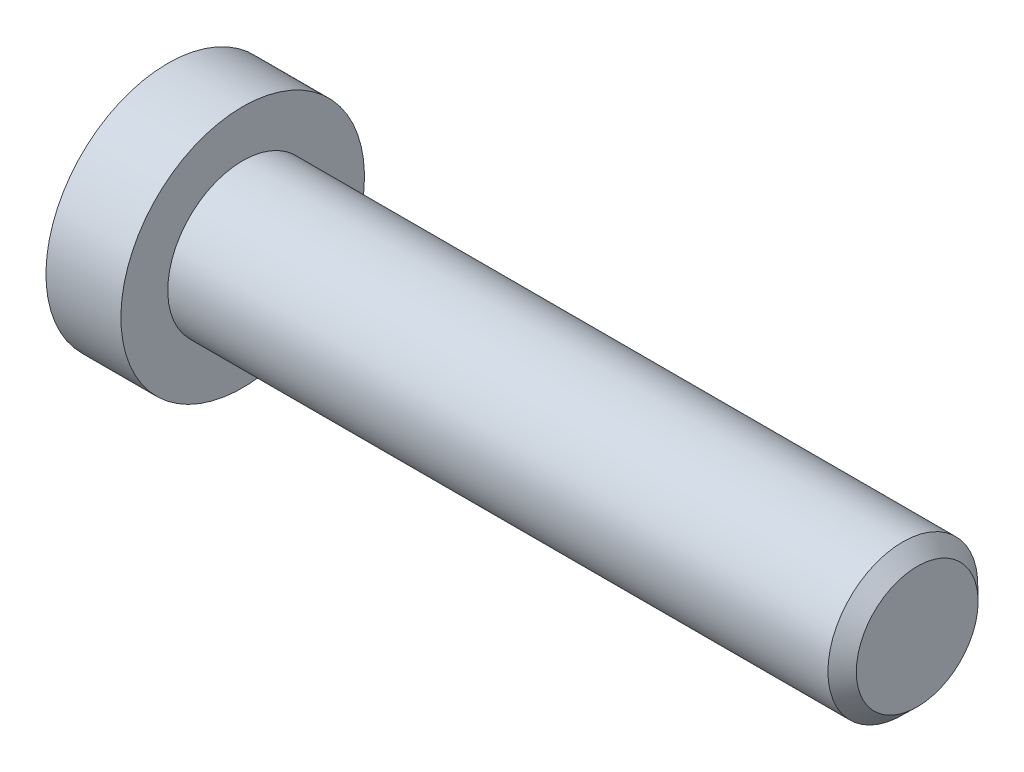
ISO-10303-21;
HEADER;
FILE_DESCRIPTION(('STEP AP214'),'2;1');
FILE_NAME('part.step','',(''),(''),'','','');
FILE_SCHEMA(('AUTOMOTIVE_DESIGN { 1 0 10303 214 1 1 1 1 }'));
ENDSEC;
DATA;
#1=APPLICATION_CONTEXT('core data for automotive mechanical design processes');
#2=APPLICATION_PROTOCOL_DEFINITION('international standard','automotive_design',2000,#1);
#3=PRODUCT_CONTEXT('',#1,'mechanical');
#4=PRODUCT('Part','Part','',(#3));
#5=PRODUCT_RELATED_PRODUCT_CATEGORY('part','',(#4));
#6=PRODUCT_DEFINITION_FORMATION('','',#4);
#7=PRODUCT_DEFINITION_CONTEXT('part definition',#1,'design');
#8=PRODUCT_DEFINITION('design','',#6,#7);
#9=PRODUCT_DEFINITION_SHAPE('','',#8);
#10=(LENGTH_UNIT() NAMED_UNIT(*) SI_UNIT(.MILLI.,.METRE.));
#11=(NAMED_UNIT(*) PLANE_ANGLE_UNIT() SI_UNIT($,.RADIAN.));
#12=(NAMED_UNIT(*) SI_UNIT($,.STERADIAN.) SOLID_ANGLE_UNIT());
#13=UNCERTAINTY_MEASURE_WITH_UNIT(LENGTH_MEASURE(1.E-05),#10,'distance_accuracy_value','');
#14=(GEOMETRIC_REPRESENTATION_CONTEXT(3) GLOBAL_UNCERTAINTY_ASSIGNED_CONTEXT((#13)) GLOBAL_UNIT_ASSIGNED_CONTEXT((#10,
#11,#12)) REPRESENTATION_CONTEXT('',''));
#15=CARTESIAN_POINT('',(0.,0.,0.));
#16=DIRECTION('',(0.,0.,1.));
#17=DIRECTION('',(1.,0.,0.));
#18=AXIS2_PLACEMENT_3D('',#15,#16,#17);
#19=CARTESIAN_POINT('',(-0.210000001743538,0.,0.));
#20=DIRECTION('',(-1.,0.,0.));
#21=DIRECTION('',(0.,0.,1.));
#22=AXIS2_PLACEMENT_3D('',#19,#20,#21);
#23=CONICAL_SURFACE('',#22,2.90407185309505,1.04719754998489);
#24=CARTESIAN_POINT('',(1.46666666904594,-5.6843418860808E-11,0.));
#25=VERTEX_POINT('',#24);
#26=VERTEX_LOOP('',#25);
#27=FACE_BOUND('',#26,.T.);
#28=CARTESIAN_POINT('',(-0.200000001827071,2.50000000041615,1.44337567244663));
#29=CARTESIAN_POINT('',(-0.163369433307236,2.50000000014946,1.31652043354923));
#30=CARTESIAN_POINT('',(-0.130055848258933,2.50000000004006,1.18857018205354));
#31=CARTESIAN_POINT('',(-0.0719079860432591,2.49999999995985,0.930454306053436));
#32=CARTESIAN_POINT('',(-0.0470942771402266,2.49999999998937,0.800284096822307));
#33=CARTESIAN_POINT('',(-0.00846995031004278,2.50000000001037,0.541556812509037));
#34=CARTESIAN_POINT('',(0.00559776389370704,2.50000000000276,0.413039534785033));
#35=CARTESIAN_POINT('',(0.0223885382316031,2.49999999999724,0.155400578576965));
#36=CARTESIAN_POINT('',(0.0251255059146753,2.49999999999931,0.0262798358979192));
#37=CARTESIAN_POINT('',(0.019417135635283,2.5000000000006,-0.214968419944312));
#38=CARTESIAN_POINT('',(0.0123733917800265,2.50000000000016,-0.327132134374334));
#39=CARTESIAN_POINT('',(-0.0099466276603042,2.49999999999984,-0.550728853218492));
#40=CARTESIAN_POINT('',(-0.0252305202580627,2.49999999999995,-0.662161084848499));
#41=CARTESIAN_POINT('',(-0.0634372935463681,2.50000000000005,-0.886218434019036));
#42=CARTESIAN_POINT('',(-0.0865220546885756,2.50000000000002,-0.998815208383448));
#43=CARTESIAN_POINT('',(-0.13891470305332,2.49999999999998,-1.22232986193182));
#44=CARTESIAN_POINT('',(-0.168210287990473,2.49999999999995,-1.33325060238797));
#45=CARTESIAN_POINT('',(-0.200000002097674,2.5,-1.44337567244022));
#46=B_SPLINE_CURVE_WITH_KNOTS('',3,(#28,#29,#30,#31,#32,#33,#34,#35,#36,#37,#38,#39,#40,#41,#42,
#43,#44,#45),.UNSPECIFIED.,.F.,.F.,(4,2,2,2,2,2,2,2,4),(0.,0.396270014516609,0.793492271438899,
1.18088450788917,1.56780111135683,1.90463472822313,2.241780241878,2.58640202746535,
2.93034746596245),.UNSPECIFIED.);
#47=CARTESIAN_POINT('',(-0.200000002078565,2.49999999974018,1.44337567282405));
#48=VERTEX_POINT('',#47);
#49=CARTESIAN_POINT('',(-0.200000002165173,2.5,-1.44337567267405));
#50=VERTEX_POINT('',#49);
#51=EDGE_CURVE('E20',#48,#50,#46,.T.);
#52=ORIENTED_EDGE('',*,*,#51,.T.);
#53=CARTESIAN_POINT('',(-0.200000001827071,2.4999999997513,-1.44337567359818));
#54=CARTESIAN_POINT('',(-0.163369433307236,2.39014014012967,-1.50680329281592));
#55=CARTESIAN_POINT('',(-0.130055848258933,2.27933197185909,-1.57077841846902));
#56=CARTESIAN_POINT('',(-0.0719079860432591,2.05579706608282,-1.6998363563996));
#57=CARTESIAN_POINT('',(-0.0470942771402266,1.94306635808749,-1.76492146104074));
#58=CARTESIAN_POINT('',(-0.00846995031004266,1.71900195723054,-1.89428510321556));
#59=CARTESIAN_POINT('',(0.0055977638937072,1.60770272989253,-1.95854374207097));
#60=CARTESIAN_POINT('',(0.0223885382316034,1.38458084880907,-2.08736322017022));
#61=CARTESIAN_POINT('',(0.0251255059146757,1.27275900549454,-2.15192359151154));
#62=CARTESIAN_POINT('',(0.0194171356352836,1.06383188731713,-2.27254771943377));
#63=CARTESIAN_POINT('',(0.0123733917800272,0.966695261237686,-2.3286295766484));
#64=CARTESIAN_POINT('',(-0.00994662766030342,0.773054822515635,-2.4404279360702));
#65=CARTESIAN_POINT('',(-0.025230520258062,0.676551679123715,-2.4961440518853));
#66=CARTESIAN_POINT('',(-0.0634372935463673,0.482512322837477,-2.60817272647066));
#67=CARTESIAN_POINT('',(-0.0865220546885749,0.3850006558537,-2.66447111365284));
#68=CARTESIAN_POINT('',(-0.138914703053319,0.191431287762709,-2.77622844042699));
#69=CARTESIAN_POINT('',(-0.168210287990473,0.0953711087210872,-2.83168881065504));
#70=CARTESIAN_POINT('',(-0.200000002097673,4.62322262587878E-10,-2.88675134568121));
#71=B_SPLINE_CURVE_WITH_KNOTS('',3,(#53,#54,#55,#56,#57,#58,#59,#60,#61,#62,#63,#64,#65,#66,#67,
#68,#69,#70),.UNSPECIFIED.,.F.,.F.,(4,2,2,2,2,2,2,2,4),(0.,0.39627001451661,0.793492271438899,
1.18088450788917,1.56780111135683,1.90463472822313,2.241780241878,2.58640202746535,
2.93034746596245),.UNSPECIFIED.);
#72=CARTESIAN_POINT('',(-0.200000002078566,0.,-2.88675134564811));
#73=VERTEX_POINT('',#72);
#74=EDGE_CURVE('E80',#50,#73,#71,.T.);
#75=ORIENTED_EDGE('',*,*,#74,.T.);
#76=CARTESIAN_POINT('',(-0.200000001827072,-6.64844448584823E-10,-2.88675134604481));
#77=CARTESIAN_POINT('',(-0.163369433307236,-0.109859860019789,-2.82332372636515));
#78=CARTESIAN_POINT('',(-0.130055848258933,-0.220668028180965,-2.75934860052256));
#79=CARTESIAN_POINT('',(-0.0719079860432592,-0.444202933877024,-2.63029066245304));
#80=CARTESIAN_POINT('',(-0.0470942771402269,-0.55693364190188,-2.56520555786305));
#81=CARTESIAN_POINT('',(-0.00846995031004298,-0.780998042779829,-2.43584191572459));
#82=CARTESIAN_POINT('',(0.00559776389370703,-0.892297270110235,-2.37158327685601));
#83=CARTESIAN_POINT('',(0.0223885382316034,-1.11541915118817,-2.24276379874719));
#84=CARTESIAN_POINT('',(0.0251255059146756,-1.22724099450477,-2.17820342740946));
#85=CARTESIAN_POINT('',(0.0194171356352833,-1.43616811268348,-2.05757929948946));
#86=CARTESIAN_POINT('',(0.0123733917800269,-1.53330473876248,-2.00149744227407));
#87=CARTESIAN_POINT('',(-0.00994662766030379,-1.7269451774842,-1.88969908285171));
#88=CARTESIAN_POINT('',(-0.0252305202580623,-1.82344832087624,-1.83398296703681));
#89=CARTESIAN_POINT('',(-0.0634372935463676,-2.01748767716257,-1.72195429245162));
#90=CARTESIAN_POINT('',(-0.0865220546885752,-2.11499934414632,-1.6656559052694));
#91=CARTESIAN_POINT('',(-0.138914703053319,-2.30856871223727,-1.55389857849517));
#92=CARTESIAN_POINT('',(-0.168210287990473,-2.40462889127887,-1.49843820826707));
#93=CARTESIAN_POINT('',(-0.200000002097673,-2.49999999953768,-1.44337567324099));
#94=B_SPLINE_CURVE_WITH_KNOTS('',3,(#76,#77,#78,#79,#80,#81,#82,#83,#84,#85,#86,#87,#88,#89,#90,
#91,#92,#93),.UNSPECIFIED.,.F.,.F.,(4,2,2,2,2,2,2,2,4),(0.,0.39627001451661,0.7934922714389,
1.18088450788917,1.56780111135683,1.90463472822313,2.241780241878,2.58640202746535,
2.93034746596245),.UNSPECIFIED.);
#95=CARTESIAN_POINT('',(-0.200000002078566,-2.49999999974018,-1.44337567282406));
#96=VERTEX_POINT('',#95);
#97=EDGE_CURVE('E105',#73,#96,#94,.T.);
#98=ORIENTED_EDGE('',*,*,#97,.T.);
#99=CARTESIAN_POINT('',(-0.200000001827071,-2.50000000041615,-1.44337567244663));
#100=CARTESIAN_POINT('',(-0.163369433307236,-2.50000000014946,-1.31652043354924));
#101=CARTESIAN_POINT('',(-0.130055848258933,-2.50000000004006,-1.18857018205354));
#102=CARTESIAN_POINT('',(-0.0719079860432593,-2.49999999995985,-0.930454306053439));
#103=CARTESIAN_POINT('',(-0.0470942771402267,-2.49999999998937,-0.80028409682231));
#104=CARTESIAN_POINT('',(-0.00846995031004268,-2.50000000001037,-0.54155681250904));
#105=CARTESIAN_POINT('',(0.00559776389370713,-2.50000000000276,-0.413039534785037));
#106=CARTESIAN_POINT('',(0.0223885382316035,-2.49999999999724,-0.155400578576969));
#107=CARTESIAN_POINT('',(0.0251255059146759,-2.49999999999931,-0.0262798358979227));
#108=CARTESIAN_POINT('',(0.0194171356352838,-2.5000000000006,0.214968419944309));
#109=CARTESIAN_POINT('',(0.0123733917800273,-2.50000000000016,0.327132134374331));
#110=CARTESIAN_POINT('',(-0.00994662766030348,-2.49999999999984,0.550728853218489));
#111=CARTESIAN_POINT('',(-0.025230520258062,-2.49999999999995,0.662161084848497));
#112=CARTESIAN_POINT('',(-0.0634372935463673,-2.50000000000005,0.886218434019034));
#113=CARTESIAN_POINT('',(-0.0865220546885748,-2.50000000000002,0.998815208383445));
#114=CARTESIAN_POINT('',(-0.138914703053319,-2.49999999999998,1.22232986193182));
#115=CARTESIAN_POINT('',(-0.168210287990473,-2.49999999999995,1.33325060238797));
#116=CARTESIAN_POINT('',(-0.200000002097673,-2.5,1.44337567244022));
#117=B_SPLINE_CURVE_WITH_KNOTS('',3,(#99,#100,#101,#102,#103,#104,#105,#106,#107,#108,#109,#110,
#111,#112,#113,#114,#115,#116),.UNSPECIFIED.,.F.,.F.,(4,2,2,2,2,2,2,2,4),(0.,0.396270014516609,
0.793492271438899,1.18088450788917,1.56780111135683,1.90463472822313,2.241780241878,
2.58640202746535,2.93034746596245),.UNSPECIFIED.);
#118=CARTESIAN_POINT('',(-0.200000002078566,-2.49999999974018,1.44337567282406));
#119=VERTEX_POINT('',#118);
#120=EDGE_CURVE('E128',#96,#119,#117,.T.);
#121=ORIENTED_EDGE('',*,*,#120,.T.);
#122=CARTESIAN_POINT('',(-0.200000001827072,-2.4999999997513,1.44337567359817));
#123=CARTESIAN_POINT('',(-0.163369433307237,-2.39014014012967,1.50680329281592));
#124=CARTESIAN_POINT('',(-0.130055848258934,-2.27933197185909,1.57077841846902));
#125=CARTESIAN_POINT('',(-0.0719079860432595,-2.05579706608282,1.6998363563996));
#126=CARTESIAN_POINT('',(-0.047094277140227,-1.94306635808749,1.76492146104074));
#127=CARTESIAN_POINT('',(-0.00846995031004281,-1.71900195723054,1.89428510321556));
#128=CARTESIAN_POINT('',(0.00559776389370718,-1.60770272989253,1.95854374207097));
#129=CARTESIAN_POINT('',(0.0223885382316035,-1.38458084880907,2.08736322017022));
#130=CARTESIAN_POINT('',(0.0251255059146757,-1.27275900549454,2.15192359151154));
#131=CARTESIAN_POINT('',(0.0194171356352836,-1.06383188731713,2.27254771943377));
#132=CARTESIAN_POINT('',(0.0123733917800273,-0.966695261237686,2.3286295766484));
#133=CARTESIAN_POINT('',(-0.00994662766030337,-0.773054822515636,2.4404279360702));
#134=CARTESIAN_POINT('',(-0.025230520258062,-0.676551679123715,2.4961440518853));
#135=CARTESIAN_POINT('',(-0.0634372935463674,-0.482512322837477,2.60817272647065));
#136=CARTESIAN_POINT('',(-0.0865220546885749,-0.3850006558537,2.66447111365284));
#137=CARTESIAN_POINT('',(-0.138914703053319,-0.191431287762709,2.77622844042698));
#138=CARTESIAN_POINT('',(-0.168210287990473,-0.0953711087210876,2.83168881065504));
#139=CARTESIAN_POINT('',(-0.200000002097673,-4.62322479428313E-10,2.88675134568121));
#140=B_SPLINE_CURVE_WITH_KNOTS('',3,(#122,#123,#124,#125,#126,#127,#128,#129,#130,#131,#132,
#133,#134,#135,#136,#137,#138,#139),.UNSPECIFIED.,.F.,.F.,(4,2,2,2,2,2,2,2,4),(0.,
0.39627001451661,0.7934922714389,1.18088450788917,1.56780111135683,1.90463472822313,
2.24178024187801,2.58640202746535,2.93034746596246),.UNSPECIFIED.);
#141=CARTESIAN_POINT('',(-0.200000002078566,0.,2.88675134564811));
#142=VERTEX_POINT('',#141);
#143=EDGE_CURVE('E136',#119,#142,#140,.T.);
#144=ORIENTED_EDGE('',*,*,#143,.T.);
#145=CARTESIAN_POINT('',(-0.200000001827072,6.64843676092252E-10,2.88675134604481));
#146=CARTESIAN_POINT('',(-0.163369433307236,0.109859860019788,2.82332372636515));
#147=CARTESIAN_POINT('',(-0.130055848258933,0.220668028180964,2.75934860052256));
#148=CARTESIAN_POINT('',(-0.0719079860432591,0.444202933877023,2.63029066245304));
#149=CARTESIAN_POINT('',(-0.0470942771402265,0.556933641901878,2.56520555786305));
#150=CARTESIAN_POINT('',(-0.00846995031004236,0.780998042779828,2.43584191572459));
#151=CARTESIAN_POINT('',(0.00559776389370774,0.892297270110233,2.37158327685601));
#152=CARTESIAN_POINT('',(0.0223885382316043,1.11541915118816,2.24276379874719));
#153=CARTESIAN_POINT('',(0.0251255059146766,1.22724099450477,2.17820342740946));
#154=CARTESIAN_POINT('',(0.0194171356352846,1.43616811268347,2.05757929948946));
#155=CARTESIAN_POINT('',(0.0123733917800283,1.53330473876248,2.00149744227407));
#156=CARTESIAN_POINT('',(-0.00994662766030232,1.7269451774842,1.88969908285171));
#157=CARTESIAN_POINT('',(-0.0252305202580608,1.82344832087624,1.83398296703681));
#158=CARTESIAN_POINT('',(-0.063437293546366,2.01748767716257,1.72195429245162));
#159=CARTESIAN_POINT('',(-0.0865220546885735,2.11499934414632,1.66565590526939));
#160=CARTESIAN_POINT('',(-0.138914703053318,2.30856871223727,1.55389857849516));
#161=CARTESIAN_POINT('',(-0.168210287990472,2.40462889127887,1.49843820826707));
#162=CARTESIAN_POINT('',(-0.200000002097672,2.49999999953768,1.44337567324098));
#163=B_SPLINE_CURVE_WITH_KNOTS('',3,(#145,#146,#147,#148,#149,#150,#151,#152,#153,#154,#155,
#156,#157,#158,#159,#160,#161,#162),.UNSPECIFIED.,.F.,.F.,(4,2,2,2,2,2,2,2,4),(0.,
0.39627001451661,0.793492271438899,1.18088450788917,1.56780111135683,1.90463472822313,
2.24178024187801,2.58640202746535,2.93034746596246),.UNSPECIFIED.);
#164=EDGE_CURVE('E82',#142,#48,#163,.T.);
#165=ORIENTED_EDGE('',*,*,#164,.T.);
#166=EDGE_LOOP('',(#52,#75,#98,#121,#144,#165));
#167=FACE_BOUND('',#166,.T.);
#168=ADVANCED_FACE('F16',(#27,#167),#23,.F.);
#169=CARTESIAN_POINT('',(-4.,2.5,1.44337567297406));
#170=DIRECTION('',(0.,1.,0.));
#171=DIRECTION('',(0.,0.,1.));
#172=AXIS2_PLACEMENT_3D('',#169,#170,#171);
#173=PLANE('',#172);
#174=DIRECTION('',(1.,0.,0.));
#175=VECTOR('',#174,1.);
#176=CARTESIAN_POINT('',(-4.,2.5,1.44337567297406));
#177=LINE('',#176,#175);
#178=CARTESIAN_POINT('',(-4.,2.5,1.44337567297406));
#179=VERTEX_POINT('',#178);
#180=EDGE_CURVE('E84',#48,#179,#177,.F.);
#181=ORIENTED_EDGE('',*,*,#180,.T.);
#182=DIRECTION('',(0.,0.,1.));
#183=VECTOR('',#182,1.);
#184=CARTESIAN_POINT('',(-4.,2.5,0.));
#185=LINE('',#184,#183);
#186=CARTESIAN_POINT('',(-4.,2.5,-1.44337567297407));
#187=VERTEX_POINT('',#186);
#188=EDGE_CURVE('E89',#187,#179,#185,.T.);
#189=ORIENTED_EDGE('',*,*,#188,.F.);
#190=DIRECTION('',(1.,0.,0.));
#191=VECTOR('',#190,1.);
#192=CARTESIAN_POINT('',(-4.,2.5,-1.44337567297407));
#193=LINE('',#192,#191);
#194=EDGE_CURVE('E87',#187,#50,#193,.T.);
#195=ORIENTED_EDGE('',*,*,#194,.T.);
#196=ORIENTED_EDGE('',*,*,#51,.F.);
#197=EDGE_LOOP('',(#181,#189,#195,#196));
#198=FACE_BOUND('',#197,.T.);
#199=ADVANCED_FACE('F76',(#198),#173,.F.);
#200=CARTESIAN_POINT('',(-4.,0.,2.88675134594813));
#201=DIRECTION('',(0.,0.500000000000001,0.866025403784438));
#202=DIRECTION('',(0.,-0.866025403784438,0.500000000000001));
#203=AXIS2_PLACEMENT_3D('',#200,#201,#202);
#204=PLANE('',#203);
#205=DIRECTION('',(1.,0.,0.));
#206=VECTOR('',#205,1.);
#207=CARTESIAN_POINT('',(-4.,0.,2.88675134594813));
#208=LINE('',#207,#206);
#209=CARTESIAN_POINT('',(-4.,0.,2.88675134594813));
#210=VERTEX_POINT('',#209);
#211=EDGE_CURVE('E140',#142,#210,#208,.F.);
#212=ORIENTED_EDGE('',*,*,#211,.T.);
#213=DIRECTION('',(0.,-0.866025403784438,0.500000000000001));
#214=VECTOR('',#213,1.);
#215=CARTESIAN_POINT('',(-4.,2.5,1.44337567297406));
#216=LINE('',#215,#214);
#217=EDGE_CURVE('E95',#179,#210,#216,.T.);
#218=ORIENTED_EDGE('',*,*,#217,.F.);
#219=ORIENTED_EDGE('',*,*,#180,.F.);
#220=ORIENTED_EDGE('',*,*,#164,.F.);
#221=EDGE_LOOP('',(#212,#218,#219,#220));
#222=FACE_BOUND('',#221,.T.);
#223=ADVANCED_FACE('F144',(#222),#204,.F.);
#224=CARTESIAN_POINT('',(-4.,-2.5,1.44337567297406));
#225=DIRECTION('',(0.,-0.5,0.866025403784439));
#226=DIRECTION('',(0.,-0.866025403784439,-0.5));
#227=AXIS2_PLACEMENT_3D('',#224,#225,#226);
#228=PLANE('',#227);
#229=DIRECTION('',(1.,0.,0.));
#230=VECTOR('',#229,1.);
#231=CARTESIAN_POINT('',(-4.,-2.5,1.44337567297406));
#232=LINE('',#231,#230);
#233=CARTESIAN_POINT('',(-4.,-2.5,1.44337567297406));
#234=VERTEX_POINT('',#233);
#235=EDGE_CURVE('E135',#119,#234,#232,.F.);
#236=ORIENTED_EDGE('',*,*,#235,.T.);
#237=DIRECTION('',(0.,-0.866025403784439,-0.5));
#238=VECTOR('',#237,1.);
#239=CARTESIAN_POINT('',(-4.,0.,2.88675134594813));
#240=LINE('',#239,#238);
#241=EDGE_CURVE('E195',#210,#234,#240,.T.);
#242=ORIENTED_EDGE('',*,*,#241,.F.);
#243=ORIENTED_EDGE('',*,*,#211,.F.);
#244=ORIENTED_EDGE('',*,*,#143,.F.);
#245=EDGE_LOOP('',(#236,#242,#243,#244));
#246=FACE_BOUND('',#245,.T.);
#247=ADVANCED_FACE('F124',(#246),#228,.F.);
#248=CARTESIAN_POINT('',(-4.,-2.5,-1.44337567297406));
#249=DIRECTION('',(0.,-1.,0.));
#250=DIRECTION('',(0.,0.,-1.));
#251=AXIS2_PLACEMENT_3D('',#248,#249,#250);
#252=PLANE('',#251);
#253=DIRECTION('',(1.,0.,0.));
#254=VECTOR('',#253,1.);
#255=CARTESIAN_POINT('',(-4.,-2.5,-1.44337567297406));
#256=LINE('',#255,#254);
#257=CARTESIAN_POINT('',(-4.,-2.5,-1.44337567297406));
#258=VERTEX_POINT('',#257);
#259=EDGE_CURVE('E134',#96,#258,#256,.F.);
#260=ORIENTED_EDGE('',*,*,#259,.T.);
#261=DIRECTION('',(0.,0.,1.));
#262=VECTOR('',#261,1.);
#263=CARTESIAN_POINT('',(-4.,-2.5,0.));
#264=LINE('',#263,#262);
#265=EDGE_CURVE('E198',#234,#258,#264,.F.);
#266=ORIENTED_EDGE('',*,*,#265,.F.);
#267=ORIENTED_EDGE('',*,*,#235,.F.);
#268=ORIENTED_EDGE('',*,*,#120,.F.);
#269=EDGE_LOOP('',(#260,#266,#267,#268));
#270=FACE_BOUND('',#269,.T.);
#271=ADVANCED_FACE('F120',(#270),#252,.F.);
#272=CARTESIAN_POINT('',(-4.,0.,-2.88675134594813));
#273=DIRECTION('',(0.,-0.5,-0.866025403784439));
#274=DIRECTION('',(0.,0.866025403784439,-0.5));
#275=AXIS2_PLACEMENT_3D('',#272,#273,#274);
#276=PLANE('',#275);
#277=DIRECTION('',(1.,0.,0.));
#278=VECTOR('',#277,1.);
#279=CARTESIAN_POINT('',(-4.,0.,-2.88675134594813));
#280=LINE('',#279,#278);
#281=CARTESIAN_POINT('',(-4.,0.,-2.88675134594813));
#282=VERTEX_POINT('',#281);
#283=EDGE_CURVE('E38',#73,#282,#280,.F.);
#284=ORIENTED_EDGE('',*,*,#283,.T.);
#285=DIRECTION('',(0.,0.866025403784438,-0.500000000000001));
#286=VECTOR('',#285,1.);
#287=CARTESIAN_POINT('',(-4.,-2.5,-1.44337567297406));
#288=LINE('',#287,#286);
#289=EDGE_CURVE('E201',#258,#282,#288,.T.);
#290=ORIENTED_EDGE('',*,*,#289,.F.);
#291=ORIENTED_EDGE('',*,*,#259,.F.);
#292=ORIENTED_EDGE('',*,*,#97,.F.);
#293=EDGE_LOOP('',(#284,#290,#291,#292));
#294=FACE_BOUND('',#293,.T.);
#295=ADVANCED_FACE('F115',(#294),#276,.F.);
#296=CARTESIAN_POINT('',(-4.,2.5,-1.44337567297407));
#297=DIRECTION('',(0.,0.5,-0.866025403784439));
#298=DIRECTION('',(0.,0.866025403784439,0.5));
#299=AXIS2_PLACEMENT_3D('',#296,#297,#298);
#300=PLANE('',#299);
#301=ORIENTED_EDGE('',*,*,#194,.F.);
#302=DIRECTION('',(0.,0.866025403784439,0.5));
#303=VECTOR('',#302,1.);
#304=CARTESIAN_POINT('',(-4.,0.,-2.88675134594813));
#305=LINE('',#304,#303);
#306=EDGE_CURVE('E189',#282,#187,#305,.T.);
#307=ORIENTED_EDGE('',*,*,#306,.F.);
#308=ORIENTED_EDGE('',*,*,#283,.F.);
#309=ORIENTED_EDGE('',*,*,#74,.F.);
#310=EDGE_LOOP('',(#301,#307,#308,#309));
#311=FACE_BOUND('',#310,.T.);
#312=ADVANCED_FACE('F93',(#311),#300,.F.);
#313=CARTESIAN_POINT('',(-4.,4.69337567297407,0.));
#314=DIRECTION('',(-1.,0.,0.));
#315=DIRECTION('',(0.,0.,1.));
#316=AXIS2_PLACEMENT_3D('',#313,#314,#315);
#317=PLANE('',#316);
#318=ORIENTED_EDGE('',*,*,#289,.T.);
#319=ORIENTED_EDGE('',*,*,#306,.T.);
#320=ORIENTED_EDGE('',*,*,#188,.T.);
#321=ORIENTED_EDGE('',*,*,#217,.T.);
#322=ORIENTED_EDGE('',*,*,#241,.T.);
#323=ORIENTED_EDGE('',*,*,#265,.T.);
#324=EDGE_LOOP('',(#318,#319,#320,#321,#322,#323));
#325=FACE_BOUND('',#324,.T.);
#326=CARTESIAN_POINT('',(-4.,0.,0.));
#327=DIRECTION('',(1.,0.,0.));
#328=DIRECTION('',(0.,1.,0.));
#329=AXIS2_PLACEMENT_3D('',#326,#327,#328);
#330=CIRCLE('',#329,6.5);
#331=CARTESIAN_POINT('',(-4.,6.5,0.));
#332=VERTEX_POINT('',#331);
#333=EDGE_CURVE('E103',#332,#332,#330,.T.);
#334=ORIENTED_EDGE('',*,*,#333,.F.);
#335=EDGE_LOOP('',(#334));
#336=FACE_BOUND('',#335,.T.);
#337=ADVANCED_FACE('F114',(#325,#336),#317,.T.);
#338=CARTESIAN_POINT('',(-2.,0.,0.));
#339=DIRECTION('',(1.,0.,0.));
#340=DIRECTION('',(0.,1.,0.));
#341=AXIS2_PLACEMENT_3D('',#338,#339,#340);
#342=CYLINDRICAL_SURFACE('',#341,6.5);
#343=ORIENTED_EDGE('',*,*,#333,.T.);
#344=EDGE_LOOP('',(#343));
#345=FACE_BOUND('',#344,.T.);
#346=CARTESIAN_POINT('',(0.,0.,0.));
#347=DIRECTION('',(1.,0.,0.));
#348=DIRECTION('',(0.,1.,0.));
#349=AXIS2_PLACEMENT_3D('',#346,#347,#348);
#350=CIRCLE('',#349,6.5);
#351=CARTESIAN_POINT('',(0.,6.5,0.));
#352=VERTEX_POINT('',#351);
#353=EDGE_CURVE('E184',#352,#352,#350,.T.);
#354=ORIENTED_EDGE('',*,*,#353,.F.);
#355=EDGE_LOOP('',(#354));
#356=FACE_BOUND('',#355,.T.);
#357=ADVANCED_FACE('F171',(#345,#356),#342,.T.);
#358=CARTESIAN_POINT('',(36.,2.,0.));
#359=DIRECTION('',(1.,0.,0.));
#360=DIRECTION('',(0.,0.,-1.));
#361=AXIS2_PLACEMENT_3D('',#358,#359,#360);
#362=PLANE('',#361);
#363=CARTESIAN_POINT('',(36.0000000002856,0.,0.));
#364=DIRECTION('',(-1.,0.,0.));
#365=DIRECTION('',(0.,0.,1.));
#366=AXIS2_PLACEMENT_3D('',#363,#364,#365);
#367=CIRCLE('',#366,3.2500000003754);
#368=CARTESIAN_POINT('',(36.0000000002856,0.,3.2500000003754));
#369=VERTEX_POINT('',#368);
#370=EDGE_CURVE('E186',#369,#369,#367,.T.);
#371=ORIENTED_EDGE('',*,*,#370,.F.);
#372=EDGE_LOOP('',(#371));
#373=FACE_BOUND('',#372,.T.);
#374=ADVANCED_FACE('F168',(#373),#362,.T.);
#375=CARTESIAN_POINT('',(0.,5.25,0.));
#376=DIRECTION('',(1.,0.,0.));
#377=DIRECTION('',(0.,0.,-1.));
#378=AXIS2_PLACEMENT_3D('',#375,#376,#377);
#379=PLANE('',#378);
#380=CARTESIAN_POINT('',(0.,0.,0.));
#381=DIRECTION('',(1.,0.,0.));
#382=DIRECTION('',(0.,1.,0.));
#383=AXIS2_PLACEMENT_3D('',#380,#381,#382);
#384=CIRCLE('',#383,4.);
#385=CARTESIAN_POINT('',(0.,4.,0.));
#386=VERTEX_POINT('',#385);
#387=EDGE_CURVE('E29',#386,#386,#384,.T.);
#388=ORIENTED_EDGE('',*,*,#387,.F.);
#389=EDGE_LOOP('',(#388));
#390=FACE_BOUND('',#389,.T.);
#391=ORIENTED_EDGE('',*,*,#353,.T.);
#392=EDGE_LOOP('',(#391));
#393=FACE_BOUND('',#392,.T.);
#394=ADVANCED_FACE('F161',(#390,#393),#379,.T.);
#395=CARTESIAN_POINT('',(35.2331874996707,0.,0.));
#396=DIRECTION('',(-1.,0.,0.));
#397=DIRECTION('',(0.,0.,1.));
#398=AXIS2_PLACEMENT_3D('',#395,#396,#397);
#399=CONICAL_SURFACE('',#398,3.9999999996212,0.774314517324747);
#400=ORIENTED_EDGE('',*,*,#370,.T.);
#401=EDGE_LOOP('',(#400));
#402=FACE_BOUND('',#401,.T.);
#403=CARTESIAN_POINT('',(35.2331875,0.,0.));
#404=DIRECTION('',(1.,0.,0.));
#405=DIRECTION('',(0.,1.,0.));
#406=AXIS2_PLACEMENT_3D('',#403,#404,#405);
#407=CIRCLE('',#406,4.);
#408=CARTESIAN_POINT('',(35.2331875,4.,0.));
#409=VERTEX_POINT('',#408);
#410=EDGE_CURVE('E11',#409,#409,#407,.F.);
#411=ORIENTED_EDGE('',*,*,#410,.F.);
#412=EDGE_LOOP('',(#411));
#413=FACE_BOUND('',#412,.T.);
#414=ADVANCED_FACE('F155',(#402,#413),#399,.T.);
#415=CARTESIAN_POINT('',(25.,0.,0.));
#416=DIRECTION('',(1.,0.,0.));
#417=DIRECTION('',(0.,1.,0.));
#418=AXIS2_PLACEMENT_3D('',#415,#416,#417);
#419=CYLINDRICAL_SURFACE('',#418,4.);
#420=ORIENTED_EDGE('',*,*,#410,.T.);
#421=EDGE_LOOP('',(#420));
#422=FACE_BOUND('',#421,.T.);
#423=ORIENTED_EDGE('',*,*,#387,.T.);
#424=EDGE_LOOP('',(#423));
#425=FACE_BOUND('',#424,.T.);
#426=ADVANCED_FACE('F153',(#422,#425),#419,.T.);
#427=CLOSED_SHELL('',(#168,#199,#223,#247,#271,#295,#312,#337,#357,#374,#394,#414,#426));
#428=MANIFOLD_SOLID_BREP('B1',#427);
#429=ADVANCED_BREP_SHAPE_REPRESENTATION('',(#18,#428),#14);
#430=SHAPE_DEFINITION_REPRESENTATION(#9,#429);
ENDSEC;
END-ISO-10303-21;
